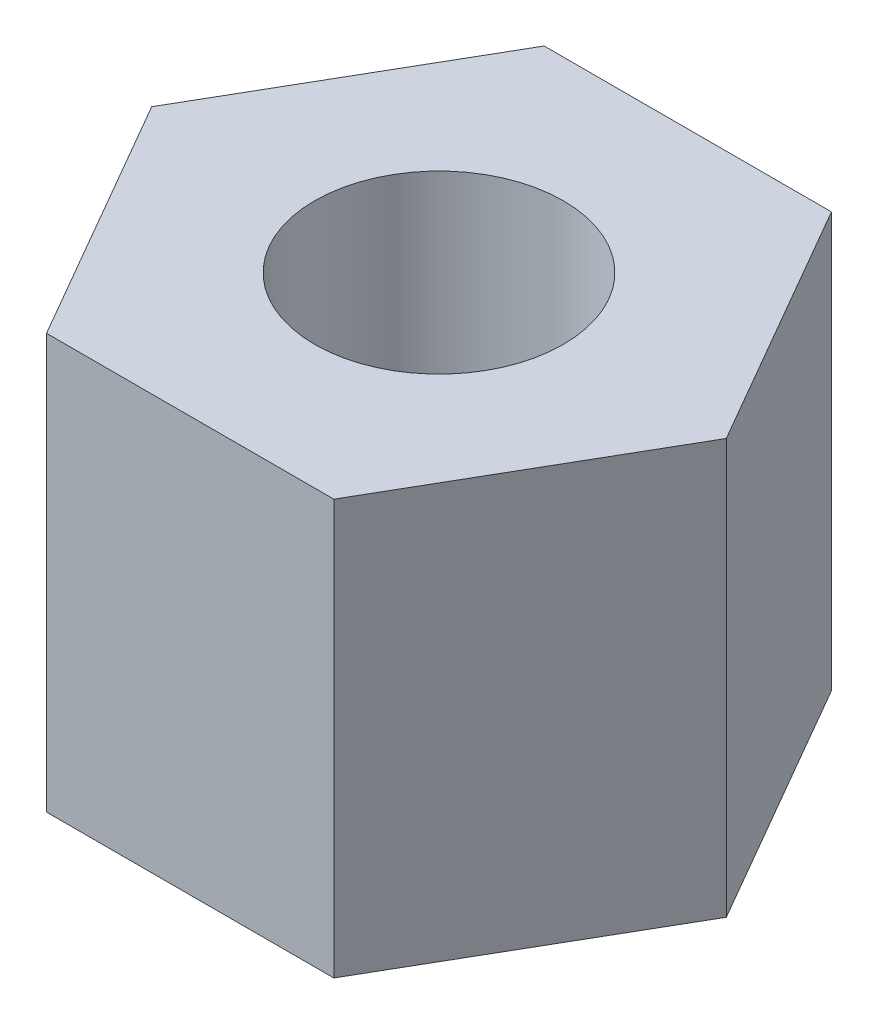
from build123d import *

# Parameters (mm, degrees)
SKETCH_1_R      = 1.5
EXTRUDE_1_DEPTH = 5


with BuildPart() as part:
    # Sketch 1 → Extrude 1 (new body)
    with BuildSketch(Plane(origin=(0, 0, 0), x_dir=(1, 0, 0), z_dir=(0, 1, 0))):
        Polygon((3.464101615, 0), (1.732050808, 3), (-1.732050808, 3), (-3.464101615, 0), (-1.732050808, -3), (1.732050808, -3), align=None)
        with Locations(Location((0, 0, 0), (0, 0, 270))):
            Circle(SKETCH_1_R, mode=Mode.SUBTRACT)
    extrude(amount=EXTRUDE_1_DEPTH)


solid = part.part
